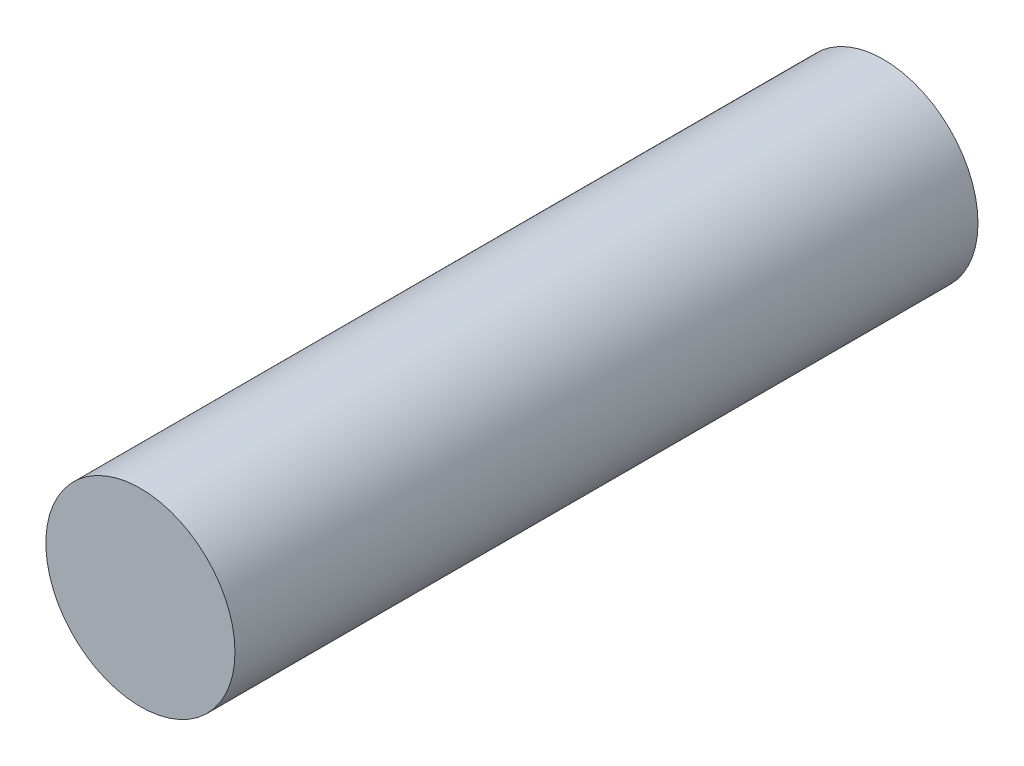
from build123d import *

# Parameters (mm, degrees)
CROQUIS1_R              = 1.4
SALIENTE_EXTRUIR1_DEPTH = 11


with BuildPart() as part:
    # Croquis1 → Saliente-Extruir1 (new body)
    with BuildSketch(Plane.XY):
        Circle(CROQUIS1_R)
    extrude(amount=SALIENTE_EXTRUIR1_DEPTH)


solid = part.part
